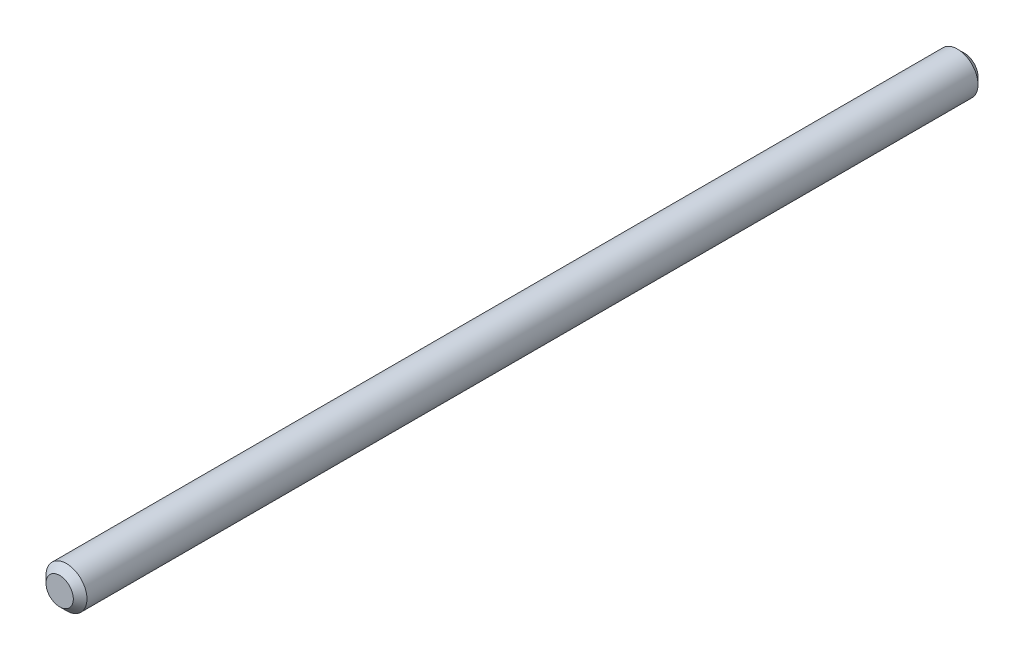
ISO-10303-21;
HEADER;
FILE_DESCRIPTION(('STEP AP214'),'2;1');
FILE_NAME('part.step','',(''),(''),'','','');
FILE_SCHEMA(('AUTOMOTIVE_DESIGN { 1 0 10303 214 1 1 1 1 }'));
ENDSEC;
DATA;
#1=APPLICATION_CONTEXT('core data for automotive mechanical design processes');
#2=APPLICATION_PROTOCOL_DEFINITION('international standard','automotive_design',2000,#1);
#3=PRODUCT_CONTEXT('',#1,'mechanical');
#4=PRODUCT('Part','Part','',(#3));
#5=PRODUCT_RELATED_PRODUCT_CATEGORY('part','',(#4));
#6=PRODUCT_DEFINITION_FORMATION('','',#4);
#7=PRODUCT_DEFINITION_CONTEXT('part definition',#1,'design');
#8=PRODUCT_DEFINITION('design','',#6,#7);
#9=PRODUCT_DEFINITION_SHAPE('','',#8);
#10=(LENGTH_UNIT() NAMED_UNIT(*) SI_UNIT(.MILLI.,.METRE.));
#11=(NAMED_UNIT(*) PLANE_ANGLE_UNIT() SI_UNIT($,.RADIAN.));
#12=(NAMED_UNIT(*) SI_UNIT($,.STERADIAN.) SOLID_ANGLE_UNIT());
#13=UNCERTAINTY_MEASURE_WITH_UNIT(LENGTH_MEASURE(1.E-05),#10,'distance_accuracy_value','');
#14=(GEOMETRIC_REPRESENTATION_CONTEXT(3) GLOBAL_UNCERTAINTY_ASSIGNED_CONTEXT((#13)) GLOBAL_UNIT_ASSIGNED_CONTEXT((#10,
#11,#12)) REPRESENTATION_CONTEXT('',''));
#15=CARTESIAN_POINT('',(0.,0.,0.));
#16=DIRECTION('',(0.,0.,1.));
#17=DIRECTION('',(1.,0.,0.));
#18=AXIS2_PLACEMENT_3D('',#15,#16,#17);
#19=CARTESIAN_POINT('',(0.,0.,66.25));
#20=DIRECTION('',(0.,0.,-1.));
#21=DIRECTION('',(-1.,0.,0.));
#22=AXIS2_PLACEMENT_3D('',#19,#20,#21);
#23=PLANE('',#22);
#24=CARTESIAN_POINT('',(0.,0.,66.2500000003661));
#25=DIRECTION('',(0.,0.,-1.));
#26=DIRECTION('',(-1.,0.,0.));
#27=AXIS2_PLACEMENT_3D('',#24,#25,#26);
#28=CIRCLE('',#27,2.0000000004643);
#29=CARTESIAN_POINT('',(-2.0000000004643,0.,66.2500000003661));
#30=VERTEX_POINT('',#29);
#31=EDGE_CURVE('E17',#30,#30,#28,.T.);
#32=ORIENTED_EDGE('',*,*,#31,.F.);
#33=EDGE_LOOP('',(#32));
#34=FACE_BOUND('',#33,.T.);
#35=ADVANCED_FACE('F14',(#34),#23,.F.);
#36=CARTESIAN_POINT('',(0.,0.,-66.25));
#37=DIRECTION('',(0.,0.,-1.));
#38=DIRECTION('',(-1.,0.,0.));
#39=AXIS2_PLACEMENT_3D('',#36,#37,#38);
#40=PLANE('',#39);
#41=CARTESIAN_POINT('',(0.,0.,-66.2500000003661));
#42=DIRECTION('',(0.,0.,1.));
#43=DIRECTION('',(1.,0.,0.));
#44=AXIS2_PLACEMENT_3D('',#41,#42,#43);
#45=CIRCLE('',#44,2.0000000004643);
#46=CARTESIAN_POINT('',(2.0000000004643,0.,-66.2500000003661));
#47=VERTEX_POINT('',#46);
#48=EDGE_CURVE('E26',#47,#47,#45,.T.);
#49=ORIENTED_EDGE('',*,*,#48,.F.);
#50=EDGE_LOOP('',(#49));
#51=FACE_BOUND('',#50,.T.);
#52=ADVANCED_FACE('F41',(#51),#40,.T.);
#53=CARTESIAN_POINT('',(0.,0.,65.2499999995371));
#54=DIRECTION('',(0.,0.,-1.));
#55=DIRECTION('',(-1.,0.,0.));
#56=AXIS2_PLACEMENT_3D('',#53,#54,#55);
#57=CONICAL_SURFACE('',#56,2.99999999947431,0.785398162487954);
#58=CARTESIAN_POINT('',(0.,0.,65.25));
#59=DIRECTION('',(0.,0.,1.));
#60=DIRECTION('',(1.,0.,0.));
#61=AXIS2_PLACEMENT_3D('',#58,#59,#60);
#62=CIRCLE('',#61,3.);
#63=CARTESIAN_POINT('',(3.,0.,65.25));
#64=VERTEX_POINT('',#63);
#65=EDGE_CURVE('E21',#64,#64,#62,.F.);
#66=ORIENTED_EDGE('',*,*,#65,.F.);
#67=EDGE_LOOP('',(#66));
#68=FACE_BOUND('',#67,.T.);
#69=ORIENTED_EDGE('',*,*,#31,.T.);
#70=EDGE_LOOP('',(#69));
#71=FACE_BOUND('',#70,.T.);
#72=ADVANCED_FACE('F38',(#68,#71),#57,.T.);
#73=CARTESIAN_POINT('',(0.,0.,-65.2499999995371));
#74=DIRECTION('',(0.,0.,1.));
#75=DIRECTION('',(1.,0.,0.));
#76=AXIS2_PLACEMENT_3D('',#73,#74,#75);
#77=CONICAL_SURFACE('',#76,2.99999999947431,0.785398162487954);
#78=CARTESIAN_POINT('',(0.,0.,-65.25));
#79=DIRECTION('',(0.,0.,1.));
#80=DIRECTION('',(1.,0.,0.));
#81=AXIS2_PLACEMENT_3D('',#78,#79,#80);
#82=CIRCLE('',#81,3.);
#83=CARTESIAN_POINT('',(3.,0.,-65.25));
#84=VERTEX_POINT('',#83);
#85=EDGE_CURVE('E10',#84,#84,#82,.T.);
#86=ORIENTED_EDGE('',*,*,#85,.F.);
#87=EDGE_LOOP('',(#86));
#88=FACE_BOUND('',#87,.T.);
#89=ORIENTED_EDGE('',*,*,#48,.T.);
#90=EDGE_LOOP('',(#89));
#91=FACE_BOUND('',#90,.T.);
#92=ADVANCED_FACE('F49',(#88,#91),#77,.T.);
#93=CARTESIAN_POINT('',(0.,0.,0.));
#94=DIRECTION('',(0.,0.,1.));
#95=DIRECTION('',(1.,0.,0.));
#96=AXIS2_PLACEMENT_3D('',#93,#94,#95);
#97=CYLINDRICAL_SURFACE('',#96,3.);
#98=ORIENTED_EDGE('',*,*,#85,.T.);
#99=EDGE_LOOP('',(#98));
#100=FACE_BOUND('',#99,.T.);
#101=ORIENTED_EDGE('',*,*,#65,.T.);
#102=EDGE_LOOP('',(#101));
#103=FACE_BOUND('',#102,.T.);
#104=ADVANCED_FACE('F47',(#100,#103),#97,.T.);
#105=CLOSED_SHELL('',(#35,#52,#72,#92,#104));
#106=MANIFOLD_SOLID_BREP('B1',#105);
#107=ADVANCED_BREP_SHAPE_REPRESENTATION('',(#18,#106),#14);
#108=SHAPE_DEFINITION_REPRESENTATION(#9,#107);
ENDSEC;
END-ISO-10303-21;
